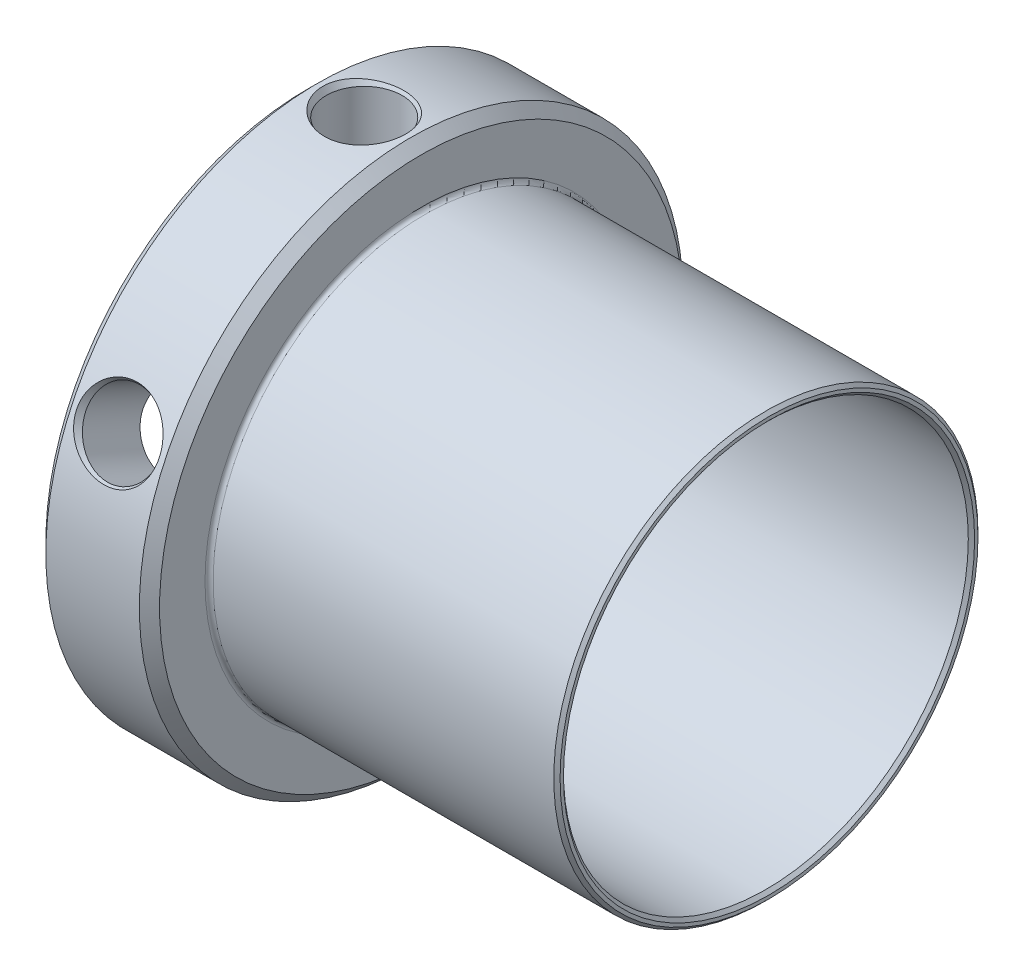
ISO-10303-21;
HEADER;
FILE_DESCRIPTION(('STEP AP214'),'2;1');
FILE_NAME('part.step','',(''),(''),'','','');
FILE_SCHEMA(('AUTOMOTIVE_DESIGN { 1 0 10303 214 1 1 1 1 }'));
ENDSEC;
DATA;
#1=APPLICATION_CONTEXT('core data for automotive mechanical design processes');
#2=APPLICATION_PROTOCOL_DEFINITION('international standard','automotive_design',2000,#1);
#3=PRODUCT_CONTEXT('',#1,'mechanical');
#4=PRODUCT('Part','Part','',(#3));
#5=PRODUCT_RELATED_PRODUCT_CATEGORY('part','',(#4));
#6=PRODUCT_DEFINITION_FORMATION('','',#4);
#7=PRODUCT_DEFINITION_CONTEXT('part definition',#1,'design');
#8=PRODUCT_DEFINITION('design','',#6,#7);
#9=PRODUCT_DEFINITION_SHAPE('','',#8);
#10=(LENGTH_UNIT() NAMED_UNIT(*) SI_UNIT(.MILLI.,.METRE.));
#11=(NAMED_UNIT(*) PLANE_ANGLE_UNIT() SI_UNIT($,.RADIAN.));
#12=(NAMED_UNIT(*) SI_UNIT($,.STERADIAN.) SOLID_ANGLE_UNIT());
#13=UNCERTAINTY_MEASURE_WITH_UNIT(LENGTH_MEASURE(1.E-05),#10,'distance_accuracy_value','');
#14=(GEOMETRIC_REPRESENTATION_CONTEXT(3) GLOBAL_UNCERTAINTY_ASSIGNED_CONTEXT((#13)) GLOBAL_UNIT_ASSIGNED_CONTEXT((#10,
#11,#12)) REPRESENTATION_CONTEXT('',''));
#15=CARTESIAN_POINT('',(0.,0.,0.));
#16=DIRECTION('',(0.,0.,1.));
#17=DIRECTION('',(1.,0.,0.));
#18=AXIS2_PLACEMENT_3D('',#15,#16,#17);
#19=CARTESIAN_POINT('',(14.3002,0.,0.));
#20=DIRECTION('',(1.,0.,0.));
#21=DIRECTION('',(0.,0.,-1.));
#22=AXIS2_PLACEMENT_3D('',#19,#20,#21);
#23=PLANE('',#22);
#24=CARTESIAN_POINT('',(14.3002,0.,0.));
#25=DIRECTION('',(1.,0.,0.));
#26=DIRECTION('',(0.,0.,-1.));
#27=AXIS2_PLACEMENT_3D('',#24,#25,#26);
#28=CIRCLE('',#27,27.178);
#29=CARTESIAN_POINT('',(14.3002,0.,-27.178));
#30=VERTEX_POINT('',#29);
#31=EDGE_CURVE('E97',#30,#30,#28,.F.);
#32=ORIENTED_EDGE('',*,*,#31,.T.);
#33=EDGE_LOOP('',(#32));
#34=FACE_BOUND('',#33,.T.);
#35=CARTESIAN_POINT('',(14.3002,0.,0.));
#36=DIRECTION('',(1.,0.,0.));
#37=DIRECTION('',(0.,0.,-1.));
#38=AXIS2_PLACEMENT_3D('',#35,#36,#37);
#39=CIRCLE('',#38,32.893);
#40=CARTESIAN_POINT('',(14.3002,0.,-32.893));
#41=VERTEX_POINT('',#40);
#42=EDGE_CURVE('E76',#41,#41,#39,.T.);
#43=ORIENTED_EDGE('',*,*,#42,.T.);
#44=EDGE_LOOP('',(#43));
#45=FACE_BOUND('',#44,.T.);
#46=ADVANCED_FACE('F17',(#34,#45),#23,.T.);
#47=CARTESIAN_POINT('',(14.3002,0.,0.));
#48=DIRECTION('',(-1.,0.,0.));
#49=DIRECTION('',(0.,0.,1.));
#50=AXIS2_PLACEMENT_3D('',#47,#48,#49);
#51=CYLINDRICAL_SURFACE('',#50,34.163);
#52=CARTESIAN_POINT('',(3.10159654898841,11.5167493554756,32.1632566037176));
#53=CARTESIAN_POINT('',(2.91411245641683,11.7253798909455,32.0885495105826));
#54=CARTESIAN_POINT('',(2.74549993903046,11.9485518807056,32.0063374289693));
#55=CARTESIAN_POINT('',(2.45216736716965,12.4171209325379,31.8274801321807));
#56=CARTESIAN_POINT('',(2.32747788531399,12.6625333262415,31.7308249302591));
#57=CARTESIAN_POINT('',(2.13097094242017,13.1574188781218,31.5287393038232));
#58=CARTESIAN_POINT('',(2.057237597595,13.4063366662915,31.4238147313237));
#59=CARTESIAN_POINT('',(1.9576876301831,13.9094002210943,31.2043961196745));
#60=CARTESIAN_POINT('',(1.93184979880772,14.1635436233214,31.0899063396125));
#61=CARTESIAN_POINT('',(1.92911987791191,14.6597955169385,30.8589233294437));
#62=CARTESIAN_POINT('',(1.9504612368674,14.90200267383,30.7426589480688));
#63=CARTESIAN_POINT('',(2.03768382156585,15.3770718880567,30.5078097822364));
#64=CARTESIAN_POINT('',(2.10356440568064,15.6099340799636,30.3892250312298));
#65=CARTESIAN_POINT('',(2.27725872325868,16.0596300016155,30.1539908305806));
#66=CARTESIAN_POINT('',(2.38496907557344,16.2765016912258,30.0373373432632));
#67=CARTESIAN_POINT('',(2.63870532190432,16.6898017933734,29.8096768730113));
#68=CARTESIAN_POINT('',(2.78473641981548,16.8862274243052,29.6986706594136));
#69=CARTESIAN_POINT('',(3.11595356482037,17.2606113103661,29.4827092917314));
#70=CARTESIAN_POINT('',(3.30226137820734,17.4377582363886,29.378069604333));
#71=CARTESIAN_POINT('',(3.70540152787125,17.7625835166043,29.1828236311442));
#72=CARTESIAN_POINT('',(3.92224014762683,17.9102557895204,29.092220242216));
#73=CARTESIAN_POINT('',(4.39056931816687,18.1794069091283,28.9248339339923));
#74=CARTESIAN_POINT('',(4.64316211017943,18.2994539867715,28.8488308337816));
#75=CARTESIAN_POINT('',(5.16808236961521,18.5026909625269,28.7189066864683));
#76=CARTESIAN_POINT('',(5.4404129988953,18.585874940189,28.6649891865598));
#77=CARTESIAN_POINT('',(6.0060959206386,18.7160277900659,28.580188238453));
#78=CARTESIAN_POINT('',(6.29983710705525,18.7618045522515,28.5500639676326));
#79=CARTESIAN_POINT('',(6.89234543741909,18.8120227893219,28.5169998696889));
#80=CARTESIAN_POINT('',(7.19111298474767,18.8164609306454,28.5140622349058));
#81=CARTESIAN_POINT('',(7.78885721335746,18.7837345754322,28.5356316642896));
#82=CARTESIAN_POINT('',(8.08779620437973,18.7460874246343,28.5604571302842));
#83=CARTESIAN_POINT('',(8.67385533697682,18.6290368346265,28.6369410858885));
#84=CARTESIAN_POINT('',(8.96097498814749,18.5496316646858,28.6886006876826));
#85=CARTESIAN_POINT('',(9.51451552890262,18.3506201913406,28.8163007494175));
#86=CARTESIAN_POINT('',(9.78097615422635,18.2310935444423,28.8922928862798));
#87=CARTESIAN_POINT('',(10.2858117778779,17.9539388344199,29.0653270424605));
#88=CARTESIAN_POINT('',(10.5241880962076,17.7963125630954,29.1623680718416));
#89=CARTESIAN_POINT('',(10.961183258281,17.4492547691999,29.3713169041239));
#90=CARTESIAN_POINT('',(11.1604450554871,17.2604522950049,29.4829229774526));
#91=CARTESIAN_POINT('',(11.5177120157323,16.8532145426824,29.7175838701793));
#92=CARTESIAN_POINT('',(11.6757272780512,16.634786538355,29.8406358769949));
#93=CARTESIAN_POINT('',(11.9393196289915,16.1828405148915,30.0880362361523));
#94=CARTESIAN_POINT('',(12.0467081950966,15.9502486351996,30.2121450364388));
#95=CARTESIAN_POINT('',(12.2138352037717,15.4690289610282,30.4613357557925));
#96=CARTESIAN_POINT('',(12.2735882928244,15.2204061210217,30.5864173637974));
#97=CARTESIAN_POINT('',(12.3415474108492,14.7254753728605,30.8276412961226));
#98=CARTESIAN_POINT('',(12.3518659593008,14.4795302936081,30.9439364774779));
#99=CARTESIAN_POINT('',(12.3263045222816,13.9869303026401,31.1696924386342));
#100=CARTESIAN_POINT('',(12.2904300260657,13.7402754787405,31.2791540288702));
#101=CARTESIAN_POINT('',(12.1747991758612,13.2575160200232,31.4867725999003));
#102=CARTESIAN_POINT('',(12.095754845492,13.0213056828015,31.5850825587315));
#103=CARTESIAN_POINT('',(11.8970591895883,12.5619820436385,31.7705617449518));
#104=CARTESIAN_POINT('',(11.7774044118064,12.3388698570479,31.8577300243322));
#105=CARTESIAN_POINT('',(11.4982638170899,11.9069897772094,32.0216922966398));
#106=CARTESIAN_POINT('',(11.337942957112,11.6986571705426,32.0982089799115));
#107=CARTESIAN_POINT('',(10.9838657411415,11.3075715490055,32.238061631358));
#108=CARTESIAN_POINT('',(10.7901027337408,11.1248236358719,32.3013949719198));
#109=CARTESIAN_POINT('',(10.3656025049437,10.7823151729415,32.4173782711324));
#110=CARTESIAN_POINT('',(10.1336287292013,10.6238904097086,32.4694478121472));
#111=CARTESIAN_POINT('',(9.6458051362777,10.3441915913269,32.5596365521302));
#112=CARTESIAN_POINT('',(9.38995083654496,10.2229245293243,32.5977531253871));
#113=CARTESIAN_POINT('',(8.8513998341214,10.016996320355,32.6616362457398));
#114=CARTESIAN_POINT('',(8.56806009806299,9.93385635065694,32.686893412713));
#115=CARTESIAN_POINT('',(7.99094227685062,9.81333242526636,32.72328019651));
#116=CARTESIAN_POINT('',(7.69716349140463,9.77595154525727,32.7344088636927));
#117=CARTESIAN_POINT('',(7.10199441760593,9.74776074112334,32.7428156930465));
#118=CARTESIAN_POINT('',(6.80056103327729,9.7577796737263,32.7398473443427));
#119=CARTESIAN_POINT('',(6.20360736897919,9.82602206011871,32.7194299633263));
#120=CARTESIAN_POINT('',(5.90808882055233,9.88425942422,32.7019767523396));
#121=CARTESIAN_POINT('',(5.33068129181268,10.0474560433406,32.6522044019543));
#122=CARTESIAN_POINT('',(5.04883202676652,10.152543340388,32.6198445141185));
#123=CARTESIAN_POINT('',(4.50811593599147,10.4063335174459,32.5397661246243));
#124=CARTESIAN_POINT('',(4.24922300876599,10.5549860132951,32.4920653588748));
#125=CARTESIAN_POINT('',(3.83908556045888,10.8382656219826,32.3984134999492));
#126=CARTESIAN_POINT('',(3.67962753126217,10.962550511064,32.3566479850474));
#127=CARTESIAN_POINT('',(3.37747000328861,11.2276931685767,32.2656033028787));
#128=CARTESIAN_POINT('',(3.23477226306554,11.3685526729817,32.2163233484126));
#129=CARTESIAN_POINT('',(3.10159654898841,11.5167493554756,32.1632566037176));
#130=B_SPLINE_CURVE_WITH_KNOTS('',3,(#52,#53,#54,#55,#56,#57,#58,#59,#60,#61,#62,#63,#64,#65,
#66,#67,#68,#69,#70,#71,#72,#73,#74,#75,#76,#77,#78,#79,#80,#81,#82,#83,#84,#85,#86,#87,#88,#89,
#90,#91,#92,#93,#94,#95,#96,#97,#98,#99,#100,#101,#102,#103,#104,#105,#106,#107,#108,#109,#110,
#111,#112,#113,#114,#115,#116,#117,#118,#119,#120,#121,#122,#123,#124,#125,#126,#127,#128,#129),
.UNSPECIFIED.,.T.,.F.,(4,2,2,2,2,2,2,2,2,2,2,2,2,2,2,2,2,2,2,2,2,2,2,2,2,2,2,2,2,2,2,2,2,2,2,2,
2,2,4),(0.,0.870031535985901,1.74066746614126,2.57646768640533,3.41189771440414,
4.21657789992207,5.02124649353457,5.8239388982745,6.62674036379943,7.45572700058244,
8.28488449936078,9.15038444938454,10.0160233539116,10.9082773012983,11.8006031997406,
12.7032686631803,13.6059715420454,14.5068927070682,15.4077715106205,16.2923027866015,
17.1766172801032,18.0262950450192,18.8757114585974,19.6884843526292,20.5011606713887,
21.3008209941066,22.1005493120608,22.9182580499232,23.7361296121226,24.5893686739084,
25.4427682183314,26.3277574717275,27.2128062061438,28.1133879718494,29.0142296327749,
29.9175485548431,30.8198268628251,31.4377722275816,32.0557823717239),.UNSPECIFIED.);
#131=CARTESIAN_POINT('',(12.3444,14.4379076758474,30.9621929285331));
#132=VERTEX_POINT('',#131);
#133=CARTESIAN_POINT('',(1.9304,14.4379076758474,30.9621929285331));
#134=VERTEX_POINT('',#133);
#135=EDGE_CURVE('E21',#132,#134,#130,.T.);
#136=ORIENTED_EDGE('',*,*,#135,.T.);
#137=EDGE_CURVE('E11',#134,#132,#130,.T.);
#138=ORIENTED_EDGE('',*,*,#137,.T.);
#139=EDGE_LOOP('',(#136,#138));
#140=FACE_BOUND('',#139,.T.);
#141=CARTESIAN_POINT('',(3.53038668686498,33.9726462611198,-3.60137131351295));
#142=CARTESIAN_POINT('',(3.74170996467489,33.951999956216,-3.79613782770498));
#143=CARTESIAN_POINT('',(3.9695953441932,33.9315337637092,-3.97322760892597));
#144=CARTESIAN_POINT('',(4.45169731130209,33.8932265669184,-4.28777489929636));
#145=CARTESIAN_POINT('',(4.70594787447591,33.8753890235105,-4.42518038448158));
#146=CARTESIAN_POINT('',(5.23881874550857,33.8439746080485,-4.65942599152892));
#147=CARTESIAN_POINT('',(5.51782214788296,33.8304891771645,-4.75540824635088));
#148=CARTESIAN_POINT('',(6.08788487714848,33.8097672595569,-4.90057358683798));
#149=CARTESIAN_POINT('',(6.3789420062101,33.8025296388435,-4.94976516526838));
#150=CARTESIAN_POINT('',(6.97122663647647,33.7950189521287,-5.00079774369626));
#151=CARTESIAN_POINT('',(7.27254075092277,33.7948898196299,-5.00166017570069));
#152=CARTESIAN_POINT('',(7.87110234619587,33.8019771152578,-4.95353227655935));
#153=CARTESIAN_POINT('',(8.16834937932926,33.8091943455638,-4.90453650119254));
#154=CARTESIAN_POINT('',(8.75142139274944,33.8301891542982,-4.7575582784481));
#155=CARTESIAN_POINT('',(9.03720020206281,33.8439908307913,-4.65939582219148));
#156=CARTESIAN_POINT('',(9.58785487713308,33.8765665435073,-4.41630717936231));
#157=CARTESIAN_POINT('',(9.85273067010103,33.8953405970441,-4.27138082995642));
#158=CARTESIAN_POINT('',(10.3510898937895,33.9354580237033,-3.9398942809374));
#159=CARTESIAN_POINT('',(10.584853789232,33.9567746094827,-3.75375305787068));
#160=CARTESIAN_POINT('',(11.0165130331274,33.9995988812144,-3.34368155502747));
#161=CARTESIAN_POINT('',(11.2144138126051,34.0211065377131,-3.11975700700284));
#162=CARTESIAN_POINT('',(11.5621268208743,34.0610690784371,-2.64736507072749));
#163=CARTESIAN_POINT('',(11.713204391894,34.0795962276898,-2.39983633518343));
#164=CARTESIAN_POINT('',(11.9695690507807,34.1121162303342,-1.88182551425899));
#165=CARTESIAN_POINT('',(12.074870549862,34.1261105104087,-1.61135068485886));
#166=CARTESIAN_POINT('',(12.2318856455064,34.1473262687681,-1.06825073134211));
#167=CARTESIAN_POINT('',(12.2858014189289,34.1548246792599,-0.796272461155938));
#168=CARTESIAN_POINT('',(12.3459859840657,34.1632097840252,-0.24701230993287));
#169=CARTESIAN_POINT('',(12.3522653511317,34.1640979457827,0.030268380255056));
#170=CARTESIAN_POINT('',(12.3175146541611,34.1592399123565,0.572932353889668));
#171=CARTESIAN_POINT('',(12.2779745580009,34.1537026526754,0.838414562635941));
#172=CARTESIAN_POINT('',(12.1554856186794,34.1369544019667,1.35895546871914));
#173=CARTESIAN_POINT('',(12.0725367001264,34.125743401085,1.61401414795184));
#174=CARTESIAN_POINT('',(11.8655549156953,34.098788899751,2.1082796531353));
#175=CARTESIAN_POINT('',(11.7412916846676,34.0830200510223,2.34738835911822));
#176=CARTESIAN_POINT('',(11.4558767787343,34.0486453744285,2.80221768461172));
#177=CARTESIAN_POINT('',(11.2947191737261,34.0300390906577,3.01793453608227));
#178=CARTESIAN_POINT('',(10.9337129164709,33.9911725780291,3.4285451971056));
#179=CARTESIAN_POINT('',(10.7326476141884,33.9708765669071,3.62236537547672));
#180=CARTESIAN_POINT('',(10.3018761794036,33.9314069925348,3.97514497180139));
#181=CARTESIAN_POINT('',(10.0721641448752,33.9122336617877,4.13409718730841));
#182=CARTESIAN_POINT('',(9.58000363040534,33.8762208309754,4.41971812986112));
#183=CARTESIAN_POINT('',(9.31657603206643,33.8595159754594,4.54471817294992));
#184=CARTESIAN_POINT('',(8.77266735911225,33.8312858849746,4.75031381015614));
#185=CARTESIAN_POINT('',(8.4921838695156,33.8197613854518,4.8309030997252));
#186=CARTESIAN_POINT('',(7.91408207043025,33.8029165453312,4.94742554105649));
#187=CARTESIAN_POINT('',(7.61620624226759,33.7977699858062,4.98210953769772));
#188=CARTESIAN_POINT('',(7.01876456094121,33.7948362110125,5.00197097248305));
#189=CARTESIAN_POINT('',(6.71919858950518,33.79704951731,4.9871449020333));
#190=CARTESIAN_POINT('',(6.1242320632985,33.8086349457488,4.90799047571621));
#191=CARTESIAN_POINT('',(5.82888787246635,33.8180672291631,4.84324607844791));
#192=CARTESIAN_POINT('',(5.25343473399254,33.8430765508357,4.66527107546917));
#193=CARTESIAN_POINT('',(4.97332626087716,33.8586537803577,4.55203896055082));
#194=CARTESIAN_POINT('',(4.43783715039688,33.8940590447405,4.28041154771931));
#195=CARTESIAN_POINT('',(4.18234802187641,33.9138670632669,4.12222779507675));
#196=CARTESIAN_POINT('',(3.70247732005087,33.9554538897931,3.76431450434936));
#197=CARTESIAN_POINT('',(3.47809326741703,33.9772325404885,3.56458828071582));
#198=CARTESIAN_POINT('',(3.07247485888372,34.0196509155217,3.13363125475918));
#199=CARTESIAN_POINT('',(2.8903851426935,34.0403052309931,2.90320807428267));
#200=CARTESIAN_POINT('',(2.56942193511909,34.0785038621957,2.41375758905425));
#201=CARTESIAN_POINT('',(2.43053642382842,34.0960490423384,2.15473826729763));
#202=CARTESIAN_POINT('',(2.20615546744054,34.1252077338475,1.62713073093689));
#203=CARTESIAN_POINT('',(2.11865351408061,34.1370403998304,1.3594081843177));
#204=CARTESIAN_POINT('',(1.99156552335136,34.1544264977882,0.812647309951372));
#205=CARTESIAN_POINT('',(1.95196439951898,34.1599819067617,0.533612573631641));
#206=CARTESIAN_POINT('',(1.92284190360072,34.1640572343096,-0.0158553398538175));
#207=CARTESIAN_POINT('',(1.93137804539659,34.1628500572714,-0.286185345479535));
#208=CARTESIAN_POINT('',(1.99371368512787,34.1541704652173,-0.821507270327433));
#209=CARTESIAN_POINT('',(2.04751879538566,34.1466972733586,-1.08649852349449));
#210=CARTESIAN_POINT('',(2.19780141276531,34.126405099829,-1.60158085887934));
#211=CARTESIAN_POINT('',(2.29394693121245,34.1136277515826,-1.85177101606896));
#212=CARTESIAN_POINT('',(2.52548938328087,34.0841115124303,-2.33280009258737));
#213=CARTESIAN_POINT('',(2.66085422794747,34.0673758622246,-2.56365463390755));
#214=CARTESIAN_POINT('',(2.91786265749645,34.0373582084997,-2.93108953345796));
#215=CARTESIAN_POINT('',(3.03021362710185,34.0246670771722,-3.07432783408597));
#216=CARTESIAN_POINT('',(3.26962929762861,33.9988420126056,-3.34785926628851));
#217=CARTESIAN_POINT('',(3.39669356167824,33.9857080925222,-3.4781527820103));
#218=CARTESIAN_POINT('',(3.53038668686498,33.9726462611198,-3.60137131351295));
#219=B_SPLINE_CURVE_WITH_KNOTS('',3,(#141,#142,#143,#144,#145,#146,#147,#148,#149,#150,#151,
#152,#153,#154,#155,#156,#157,#158,#159,#160,#161,#162,#163,#164,#165,#166,#167,#168,#169,#170,
#171,#172,#173,#174,#175,#176,#177,#178,#179,#180,#181,#182,#183,#184,#185,#186,#187,#188,#189,
#190,#191,#192,#193,#194,#195,#196,#197,#198,#199,#200,#201,#202,#203,#204,#205,#206,#207,#208,
#209,#210,#211,#212,#213,#214,#215,#216,#217,#218),.UNSPECIFIED.,.T.,.F.,(4,2,2,2,2,2,2,2,2,2,2,
2,2,2,2,2,2,2,2,2,2,2,2,2,2,2,2,2,2,2,2,2,2,2,2,2,2,2,4),(0.,0.863735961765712,1.72859914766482,
2.61060174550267,3.49244422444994,4.39213592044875,5.29192586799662,6.19503447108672,
7.09814621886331,7.99246746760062,8.88665316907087,9.75399363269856,10.621060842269,
11.4490322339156,12.2768198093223,13.0784270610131,13.8800357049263,14.6861911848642,
15.4924763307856,16.3287661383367,17.1652285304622,18.0374144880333,18.909724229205,
19.805313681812,20.7009666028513,21.604166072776,22.5073936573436,23.4064390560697,
24.3054127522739,25.1842115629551,26.0627656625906,26.9042283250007,27.7454258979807,
28.5529279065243,29.3605300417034,30.1619095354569,30.9626351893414,31.5090917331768,
32.0555320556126),.UNSPECIFIED.);
#220=CARTESIAN_POINT('',(1.9304,34.163,0.));
#221=VERTEX_POINT('',#220);
#222=CARTESIAN_POINT('',(12.3444000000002,34.163,0.));
#223=VERTEX_POINT('',#222);
#224=EDGE_CURVE('E52',#221,#223,#219,.T.);
#225=ORIENTED_EDGE('',*,*,#224,.T.);
#226=EDGE_CURVE('E40',#223,#221,#219,.T.);
#227=ORIENTED_EDGE('',*,*,#226,.T.);
#228=EDGE_LOOP('',(#225,#227));
#229=FACE_BOUND('',#228,.T.);
#230=CARTESIAN_POINT('',(1.27,0.,0.));
#231=DIRECTION('',(1.,0.,0.));
#232=DIRECTION('',(0.,0.,-1.));
#233=AXIS2_PLACEMENT_3D('',#230,#231,#232);
#234=CIRCLE('',#233,34.163);
#235=CARTESIAN_POINT('',(1.27,0.,-34.163));
#236=VERTEX_POINT('',#235);
#237=EDGE_CURVE('E56',#236,#236,#234,.T.);
#238=ORIENTED_EDGE('',*,*,#237,.T.);
#239=EDGE_LOOP('',(#238));
#240=FACE_BOUND('',#239,.T.);
#241=CARTESIAN_POINT('',(13.0302,0.,0.));
#242=DIRECTION('',(1.,0.,0.));
#243=DIRECTION('',(0.,0.,-1.));
#244=AXIS2_PLACEMENT_3D('',#241,#242,#243);
#245=CIRCLE('',#244,34.163);
#246=CARTESIAN_POINT('',(13.0302,0.,-34.163));
#247=VERTEX_POINT('',#246);
#248=EDGE_CURVE('E59',#247,#247,#245,.F.);
#249=ORIENTED_EDGE('',*,*,#248,.T.);
#250=EDGE_LOOP('',(#249));
#251=FACE_BOUND('',#250,.T.);
#252=ADVANCED_FACE('F47',(#140,#229,#240,#251),#51,.T.);
#253=CARTESIAN_POINT('',(0.,0.,0.));
#254=DIRECTION('',(1.,0.,0.));
#255=DIRECTION('',(0.,0.,-1.));
#256=AXIS2_PLACEMENT_3D('',#253,#254,#255);
#257=PLANE('',#256);
#258=CARTESIAN_POINT('',(0.,0.,0.));
#259=DIRECTION('',(1.,0.,0.));
#260=DIRECTION('',(0.,0.,-1.));
#261=AXIS2_PLACEMENT_3D('',#258,#259,#260);
#262=CIRCLE('',#261,25.847675);
#263=CARTESIAN_POINT('',(0.,0.,-25.847675));
#264=VERTEX_POINT('',#263);
#265=EDGE_CURVE('E85',#264,#264,#262,.T.);
#266=ORIENTED_EDGE('',*,*,#265,.T.);
#267=EDGE_LOOP('',(#266));
#268=FACE_BOUND('',#267,.T.);
#269=CARTESIAN_POINT('',(0.,0.,0.));
#270=DIRECTION('',(1.,0.,0.));
#271=DIRECTION('',(0.,0.,-1.));
#272=AXIS2_PLACEMENT_3D('',#269,#270,#271);
#273=CIRCLE('',#272,32.893);
#274=CARTESIAN_POINT('',(0.,0.,-32.893));
#275=VERTEX_POINT('',#274);
#276=EDGE_CURVE('E63',#275,#275,#273,.F.);
#277=ORIENTED_EDGE('',*,*,#276,.T.);
#278=EDGE_LOOP('',(#277));
#279=FACE_BOUND('',#278,.T.);
#280=ADVANCED_FACE('F50',(#268,#279),#257,.F.);
#281=CARTESIAN_POINT('',(1.27,0.,0.));
#282=DIRECTION('',(1.,0.,0.));
#283=DIRECTION('',(0.,0.,-1.));
#284=AXIS2_PLACEMENT_3D('',#281,#282,#283);
#285=CONICAL_SURFACE('',#284,34.163,0.785398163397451);
#286=ORIENTED_EDGE('',*,*,#276,.F.);
#287=EDGE_LOOP('',(#286));
#288=FACE_BOUND('',#287,.T.);
#289=ORIENTED_EDGE('',*,*,#237,.F.);
#290=EDGE_LOOP('',(#289));
#291=FACE_BOUND('',#290,.T.);
#292=ADVANCED_FACE('F138',(#288,#291),#285,.T.);
#293=CARTESIAN_POINT('',(14.3002,0.,0.));
#294=DIRECTION('',(-1.,0.,0.));
#295=DIRECTION('',(0.,0.,1.));
#296=AXIS2_PLACEMENT_3D('',#293,#294,#295);
#297=CONICAL_SURFACE('',#296,32.893,0.785398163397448);
#298=ORIENTED_EDGE('',*,*,#248,.F.);
#299=EDGE_LOOP('',(#298));
#300=FACE_BOUND('',#299,.T.);
#301=ORIENTED_EDGE('',*,*,#42,.F.);
#302=EDGE_LOOP('',(#301));
#303=FACE_BOUND('',#302,.T.);
#304=ADVANCED_FACE('F133',(#300,#303),#297,.T.);
#305=CARTESIAN_POINT('',(58.039,0.,0.));
#306=DIRECTION('',(-1.,0.,0.));
#307=DIRECTION('',(0.,0.,1.));
#308=AXIS2_PLACEMENT_3D('',#305,#306,#307);
#309=CYLINDRICAL_SURFACE('',#308,26.67);
#310=CARTESIAN_POINT('',(14.8082,0.,0.));
#311=DIRECTION('',(1.,0.,0.));
#312=DIRECTION('',(0.,0.,-1.));
#313=AXIS2_PLACEMENT_3D('',#310,#311,#312);
#314=CIRCLE('',#313,26.67);
#315=CARTESIAN_POINT('',(14.8082,0.,-26.67));
#316=VERTEX_POINT('',#315);
#317=EDGE_CURVE('E100',#316,#316,#314,.T.);
#318=ORIENTED_EDGE('',*,*,#317,.T.);
#319=EDGE_LOOP('',(#318));
#320=FACE_BOUND('',#319,.T.);
#321=CARTESIAN_POINT('',(57.642125,0.,0.));
#322=DIRECTION('',(1.,0.,0.));
#323=DIRECTION('',(0.,0.,-1.));
#324=AXIS2_PLACEMENT_3D('',#321,#322,#323);
#325=CIRCLE('',#324,26.67);
#326=CARTESIAN_POINT('',(57.642125,0.,-26.67));
#327=VERTEX_POINT('',#326);
#328=EDGE_CURVE('E94',#327,#327,#325,.F.);
#329=ORIENTED_EDGE('',*,*,#328,.T.);
#330=EDGE_LOOP('',(#329));
#331=FACE_BOUND('',#330,.T.);
#332=ADVANCED_FACE('F129',(#320,#331),#309,.T.);
#333=CARTESIAN_POINT('',(58.039,0.,0.));
#334=DIRECTION('',(1.,0.,0.));
#335=DIRECTION('',(0.,0.,-1.));
#336=AXIS2_PLACEMENT_3D('',#333,#334,#335);
#337=PLANE('',#336);
#338=CARTESIAN_POINT('',(58.039,0.,0.));
#339=DIRECTION('',(1.,0.,0.));
#340=DIRECTION('',(0.,0.,-1.));
#341=AXIS2_PLACEMENT_3D('',#338,#339,#340);
#342=CIRCLE('',#341,25.847675);
#343=CARTESIAN_POINT('',(58.039,0.,-25.847675));
#344=VERTEX_POINT('',#343);
#345=EDGE_CURVE('E91',#344,#344,#342,.F.);
#346=ORIENTED_EDGE('',*,*,#345,.T.);
#347=EDGE_LOOP('',(#346));
#348=FACE_BOUND('',#347,.T.);
#349=CARTESIAN_POINT('',(58.039,0.,0.));
#350=DIRECTION('',(1.,0.,0.));
#351=DIRECTION('',(0.,0.,-1.));
#352=AXIS2_PLACEMENT_3D('',#349,#350,#351);
#353=CIRCLE('',#352,26.273125);
#354=CARTESIAN_POINT('',(58.039,0.,-26.273125));
#355=VERTEX_POINT('',#354);
#356=EDGE_CURVE('E88',#355,#355,#353,.T.);
#357=ORIENTED_EDGE('',*,*,#356,.T.);
#358=EDGE_LOOP('',(#357));
#359=FACE_BOUND('',#358,.T.);
#360=ADVANCED_FACE('F125',(#348,#359),#337,.T.);
#361=CARTESIAN_POINT('',(58.04,0.,0.));
#362=DIRECTION('',(-1.,0.,0.));
#363=DIRECTION('',(0.,0.,1.));
#364=AXIS2_PLACEMENT_3D('',#361,#362,#363);
#365=CYLINDRICAL_SURFACE('',#364,25.4508);
#366=CARTESIAN_POINT('',(7.1374,6.24968817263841,24.6715345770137));
#367=CARTESIAN_POINT('',(7.40238679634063,6.24969955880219,24.6715349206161));
#368=CARTESIAN_POINT('',(7.66750570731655,6.27159976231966,24.6660159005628));
#369=CARTESIAN_POINT('',(8.19026850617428,6.35841244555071,24.6437769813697));
#370=CARTESIAN_POINT('',(8.44790584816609,6.4233614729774,24.6270475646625));
#371=CARTESIAN_POINT('',(8.9480659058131,6.59376473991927,24.581968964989));
#372=CARTESIAN_POINT('',(9.19060243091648,6.69918132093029,24.5536305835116));
#373=CARTESIAN_POINT('',(9.65417985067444,6.9467593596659,24.4847338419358));
#374=CARTESIAN_POINT('',(9.87522243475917,7.08891792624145,24.4441764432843));
#375=CARTESIAN_POINT('',(10.2922941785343,7.40699847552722,24.3496888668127));
#376=CARTESIAN_POINT('',(10.4880182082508,7.58327796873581,24.2956151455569));
#377=CARTESIAN_POINT('',(10.8462385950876,7.96285653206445,24.1738658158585));
#378=CARTESIAN_POINT('',(11.0087327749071,8.16615737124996,24.1061893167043));
#379=CARTESIAN_POINT('',(11.2970496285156,8.59504294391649,23.9566346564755));
#380=CARTESIAN_POINT('',(11.4225846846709,8.8207850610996,23.8746526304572));
#381=CARTESIAN_POINT('',(11.6315668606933,9.28616004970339,23.6975180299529));
#382=CARTESIAN_POINT('',(11.7150174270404,9.52579178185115,23.602366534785));
#383=CARTESIAN_POINT('',(11.8365184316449,10.0086799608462,23.4016471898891));
#384=CARTESIAN_POINT('',(11.8750832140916,10.2518623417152,23.2962126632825));
#385=CARTESIAN_POINT('',(11.9073204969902,10.7372102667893,23.076534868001));
#386=CARTESIAN_POINT('',(11.900996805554,10.9793758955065,22.9622923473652));
#387=CARTESIAN_POINT('',(11.8440312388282,11.4526916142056,22.7298868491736));
#388=CARTESIAN_POINT('',(11.7939431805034,11.6839414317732,22.611790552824));
#389=CARTESIAN_POINT('',(11.6517465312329,12.1324468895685,22.3743465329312));
#390=CARTESIAN_POINT('',(11.5596364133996,12.3497020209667,22.2549987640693));
#391=CARTESIAN_POINT('',(11.3354821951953,12.7660153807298,22.0188493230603));
#392=CARTESIAN_POINT('',(11.2032165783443,12.964964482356,21.9020657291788));
#393=CARTESIAN_POINT('',(10.9026691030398,13.3387229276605,21.6764715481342));
#394=CARTESIAN_POINT('',(10.7343835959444,13.513529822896,21.5676617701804));
#395=CARTESIAN_POINT('',(10.3635211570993,13.8376883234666,21.3611602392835));
#396=CARTESIAN_POINT('',(10.1604597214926,13.9866103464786,21.2636636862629));
#397=CARTESIAN_POINT('',(9.72742392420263,14.2524627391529,21.0863969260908));
#398=CARTESIAN_POINT('',(9.49744917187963,14.3693926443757,21.0066269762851));
#399=CARTESIAN_POINT('',(9.01649075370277,14.5688803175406,20.8687744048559));
#400=CARTESIAN_POINT('',(8.76547233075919,14.6513798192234,20.8107285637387));
#401=CARTESIAN_POINT('',(8.24990779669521,14.7798311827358,20.7197024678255));
#402=CARTESIAN_POINT('',(7.98536321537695,14.8257871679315,20.6867193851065));
#403=CARTESIAN_POINT('',(7.45450989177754,14.8796670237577,20.6479981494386));
#404=CARTESIAN_POINT('',(7.1882872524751,14.8881514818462,20.6418584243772));
#405=CARTESIAN_POINT('',(6.65792864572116,14.868421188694,20.6560745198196));
#406=CARTESIAN_POINT('',(6.39379257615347,14.8402082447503,20.6764290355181));
#407=CARTESIAN_POINT('',(5.87733179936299,14.748128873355,20.7422043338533));
#408=CARTESIAN_POINT('',(5.62492782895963,14.6845575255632,20.7874176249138));
#409=CARTESIAN_POINT('',(5.13655765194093,14.5233816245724,20.9003404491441));
#410=CARTESIAN_POINT('',(4.90059265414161,14.4257745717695,20.9680516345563));
#411=CARTESIAN_POINT('',(4.44881211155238,14.1972891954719,21.1234333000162));
#412=CARTESIAN_POINT('',(4.23325948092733,14.0660411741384,21.2113243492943));
#413=CARTESIAN_POINT('',(3.83116164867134,13.7736095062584,21.402367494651));
#414=CARTESIAN_POINT('',(3.64461904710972,13.6124231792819,21.5055209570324));
#415=CARTESIAN_POINT('',(3.30330544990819,13.2612160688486,21.7238718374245));
#416=CARTESIAN_POINT('',(3.14899021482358,13.0708401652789,21.839211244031));
#417=CARTESIAN_POINT('',(2.87972791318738,12.6672464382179,22.0757495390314));
#418=CARTESIAN_POINT('',(2.76477933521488,12.4540294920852,22.1969482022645));
#419=CARTESIAN_POINT('',(2.57819608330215,12.0112071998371,22.4396408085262));
#420=CARTESIAN_POINT('',(2.50633731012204,11.7816937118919,22.5611298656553));
#421=CARTESIAN_POINT('',(2.40725817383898,11.3114454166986,22.8005258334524));
#422=CARTESIAN_POINT('',(2.38003313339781,11.0707117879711,22.918433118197));
#423=CARTESIAN_POINT('',(2.37115659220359,10.5886290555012,23.145064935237));
#424=CARTESIAN_POINT('',(2.38881663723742,10.3473452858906,23.2539020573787));
#425=CARTESIAN_POINT('',(2.46770148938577,9.86759376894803,23.461503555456));
#426=CARTESIAN_POINT('',(2.5289258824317,9.62912599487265,23.5602680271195));
#427=CARTESIAN_POINT('',(2.69291187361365,9.16250363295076,23.7456252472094));
#428=CARTESIAN_POINT('',(2.79560046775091,8.93433169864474,23.832239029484));
#429=CARTESIAN_POINT('',(3.03951749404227,8.49464194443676,23.9924801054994));
#430=CARTESIAN_POINT('',(3.18074849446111,8.28312523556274,24.0661065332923));
#431=CARTESIAN_POINT('',(3.50011236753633,7.88025293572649,24.2010468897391));
#432=CARTESIAN_POINT('',(3.67874274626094,7.68922785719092,24.2621702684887));
#433=CARTESIAN_POINT('',(4.0668021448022,7.33686750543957,24.371042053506));
#434=CARTESIAN_POINT('',(4.27623839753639,7.17553922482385,24.4187873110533));
#435=CARTESIAN_POINT('',(4.72227164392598,6.88663476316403,24.5018438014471));
#436=CARTESIAN_POINT('',(4.95910101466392,6.7593831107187,24.5370364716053));
#437=CARTESIAN_POINT('',(5.45160505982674,6.54526603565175,24.5950222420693));
#438=CARTESIAN_POINT('',(5.70726166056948,6.45836245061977,24.6178270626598));
#439=CARTESIAN_POINT('',(6.15929796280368,6.34570452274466,24.6470604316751));
#440=CARTESIAN_POINT('',(6.35302938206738,6.30977233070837,24.6562489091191));
#441=CARTESIAN_POINT('',(6.74361626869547,6.26176024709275,24.6684857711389));
#442=CARTESIAN_POINT('',(6.94047165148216,6.24967971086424,24.6715343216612));
#443=CARTESIAN_POINT('',(7.1374,6.24968817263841,24.6715345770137));
#444=B_SPLINE_CURVE_WITH_KNOTS('',3,(#366,#367,#368,#369,#370,#371,#372,#373,#374,#375,#376,
#377,#378,#379,#380,#381,#382,#383,#384,#385,#386,#387,#388,#389,#390,#391,#392,#393,#394,#395,
#396,#397,#398,#399,#400,#401,#402,#403,#404,#405,#406,#407,#408,#409,#410,#411,#412,#413,#414,
#415,#416,#417,#418,#419,#420,#421,#422,#423,#424,#425,#426,#427,#428,#429,#430,#431,#432,#433,
#434,#435,#436,#437,#438,#439,#440,#441,#442,#443),.UNSPECIFIED.,.T.,.F.,(4,2,2,2,2,2,2,2,2,2,2,
2,2,2,2,2,2,2,2,2,2,2,2,2,2,2,2,2,2,2,2,2,2,2,2,2,2,2,4),(0.,0.794239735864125,1.58915463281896,
2.38333158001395,3.17744605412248,3.98038173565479,4.78337001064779,5.5924513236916,
6.40146636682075,7.20111671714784,8.00069922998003,8.79030760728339,9.57994467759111,
10.374019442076,11.1681746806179,11.9744597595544,12.7807565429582,13.5884123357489,
14.3959769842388,15.1914183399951,15.9868205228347,16.7756822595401,17.5646019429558,
18.362593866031,19.1606572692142,19.9693392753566,20.7779902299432,21.5823982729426,
22.3867220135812,23.1787836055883,23.9708376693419,24.7615032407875,25.5522215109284,
26.3542155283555,27.1563981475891,27.9659685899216,28.7747717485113,29.3650371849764,
29.9552866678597),.UNSPECIFIED.);
#445=CARTESIAN_POINT('',(7.1374,6.24968817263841,24.6715345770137));
#446=VERTEX_POINT('',#445);
#447=EDGE_CURVE('E266',#446,#446,#444,.T.);
#448=ORIENTED_EDGE('',*,*,#447,.T.);
#449=EDGE_LOOP('',(#448));
#450=FACE_BOUND('',#449,.T.);
#451=CARTESIAN_POINT('',(7.1374,25.0012362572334,4.7625));
#452=CARTESIAN_POINT('',(7.40238679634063,25.0012413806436,4.76248982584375));
#453=CARTESIAN_POINT('',(7.66750570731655,25.0054948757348,4.74030906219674));
#454=CARTESIAN_POINT('',(8.19026850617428,25.0220281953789,4.65223147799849));
#455=CARTESIAN_POINT('',(8.44790584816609,25.0343148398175,4.5862975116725));
#456=CARTESIAN_POINT('',(8.9480659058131,25.0654752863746,4.41280866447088));
#457=CARTESIAN_POINT('',(9.19060243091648,25.0843429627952,4.3052924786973));
#458=CARTESIAN_POINT('',(9.65417985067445,25.1265323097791,4.05179355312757));
#459=CARTESIAN_POINT('',(9.87522243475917,25.149853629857,3.90581383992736));
#460=CARTESIAN_POINT('',(10.2922941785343,25.1986454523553,3.57760278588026));
#461=CARTESIAN_POINT('',(10.4880182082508,25.2241369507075,3.39498676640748));
#462=CARTESIAN_POINT('',(10.8462385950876,25.2742114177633,2.99951826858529));
#463=CARTESIAN_POINT('',(11.0087327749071,25.2987943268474,2.78666381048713));
#464=CARTESIAN_POINT('',(11.2970496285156,25.3445066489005,2.33475694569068));
#465=CARTESIAN_POINT('',(11.4225846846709,25.3656084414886,2.09551800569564));
#466=CARTESIAN_POINT('',(11.6315668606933,25.4017459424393,1.59888471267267));
#467=CARTESIAN_POINT('',(11.7150174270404,25.4167821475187,1.34149184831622));
#468=CARTESIAN_POINT('',(11.8365184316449,25.4389460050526,0.819018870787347));
#469=CARTESIAN_POINT('',(11.8750832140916,25.4461631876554,0.554062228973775));
#470=CARTESIAN_POINT('',(11.9073204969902,25.452184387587,0.0213477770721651));
#471=CARTESIAN_POINT('',(11.900996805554,25.4509891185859,-0.246409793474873));
#472=CARTESIAN_POINT('',(11.8440312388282,25.4403900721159,-0.773598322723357));
#473=CARTESIAN_POINT('',(11.7939431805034,25.4310888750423,-1.033091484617));
#474=CARTESIAN_POINT('',(11.6517465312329,25.4054381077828,-1.53992365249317));
#475=CARTESIAN_POINT('',(11.5596364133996,25.3890882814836,-1.78726221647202));
#476=CARTESIAN_POINT('',(11.3354821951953,25.3510058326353,-2.26437132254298));
#477=CARTESIAN_POINT('',(11.2032165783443,25.3292434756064,-2.49403532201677));
#478=CARTESIAN_POINT('',(10.9026691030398,25.2827428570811,-2.92811573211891));
#479=CARTESIAN_POINT('',(10.7343835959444,25.2580042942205,-3.13252958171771));
#480=CARTESIAN_POINT('',(10.3635211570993,25.2078456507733,-3.51358827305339));
#481=CARTESIAN_POINT('',(10.1604597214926,25.1824209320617,-3.68976128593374));
#482=CARTESIAN_POINT('',(9.72742392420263,25.1341167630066,-4.00562154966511));
#483=CARTESIAN_POINT('',(9.49744917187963,25.111237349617,-4.14530827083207));
#484=CARTESIAN_POINT('',(9.01649075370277,25.0706076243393,-4.38436451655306));
#485=CARTESIAN_POINT('',(8.7654723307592,25.0528660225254,-4.48366568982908));
#486=CARTESIAN_POINT('',(8.24990779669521,25.0246542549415,-4.63855145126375));
#487=CARTESIAN_POINT('',(7.98536321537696,25.0141832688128,-4.69414097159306));
#488=CARTESIAN_POINT('',(7.45450989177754,25.0018605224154,-4.75933700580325));
#489=CARTESIAN_POINT('',(7.1882872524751,24.9998817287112,-4.7696212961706));
#490=CARTESIAN_POINT('',(6.65792864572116,25.0044275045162,-4.74573159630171));
#491=CARTESIAN_POINT('',(6.39379257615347,25.0109516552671,-4.71155979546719));
#492=CARTESIAN_POINT('',(5.87733179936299,25.0316498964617,-4.60030970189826));
#493=CARTESIAN_POINT('',(5.62492782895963,25.0457606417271,-4.52358653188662));
#494=CARTESIAN_POINT('',(5.13655765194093,25.07998759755,-4.32978831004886));
#495=CARTESIAN_POINT('',(4.90059265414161,25.1001042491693,-4.21271029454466));
#496=CARTESIAN_POINT('',(4.44881211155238,25.1443657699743,-3.93996508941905));
#497=CARTESIAN_POINT('',(4.23325948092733,25.168554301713,-3.78386962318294));
#498=CARTESIAN_POINT('',(3.83116164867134,25.2181112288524,-3.438098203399));
#499=CARTESIAN_POINT('',(3.64461904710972,25.2434797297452,-3.24841924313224));
#500=CARTESIAN_POINT('',(3.30330544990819,25.2929462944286,-2.83783843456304));
#501=CARTESIAN_POINT('',(3.14899021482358,25.3170229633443,-2.61655473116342));
#502=CARTESIAN_POINT('',(2.87972791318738,25.3608333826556,-2.1508091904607));
#503=CARTESIAN_POINT('',(2.76477933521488,25.3805672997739,-1.90634824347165));
#504=CARTESIAN_POINT('',(2.57819608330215,25.4133767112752,-1.40244862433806));
#505=CARTESIAN_POINT('',(2.50633731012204,25.4264865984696,-1.14309526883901));
#506=CARTESIAN_POINT('',(2.40725817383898,25.4447175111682,-0.615732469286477));
#507=CARTESIAN_POINT('',(2.38003313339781,25.4498393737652,-0.347723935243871));
#508=CARTESIAN_POINT('',(2.37115659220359,25.4515005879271,0.184970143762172));
#509=CARTESIAN_POINT('',(2.38881663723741,25.4481695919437,0.449644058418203));
#510=CARTESIAN_POINT('',(2.46770148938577,25.433568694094,0.972182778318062));
#511=CARTESIAN_POINT('',(2.5289258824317,25.4222988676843,1.23004764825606));
#512=CARTESIAN_POINT('',(2.69291187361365,25.3930864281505,1.73128647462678));
#513=CARTESIAN_POINT('',(2.7956004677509,25.3751555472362,1.97468504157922));
#514=CARTESIAN_POINT('',(3.03951749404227,25.3345623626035,2.44090009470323));
#515=CARTESIAN_POINT('',(3.18074849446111,25.3118997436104,2.66371520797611));
#516=CARTESIAN_POINT('',(3.50011236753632,25.2639360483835,3.08586976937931));
#517=CARTESIAN_POINT('',(3.67874274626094,25.2386019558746,3.28482914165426));
#518=CARTESIAN_POINT('',(4.0668021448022,25.1883593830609,3.65018727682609));
#519=CARTESIAN_POINT('',(4.27623839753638,25.1634510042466,3.81657837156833));
#520=CARTESIAN_POINT('',(4.72227164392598,25.1166294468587,4.11351592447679));
#521=CARTESIAN_POINT('',(4.95910101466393,25.0947459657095,4.24371815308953));
#522=CARTESIAN_POINT('',(5.45160505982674,25.0568091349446,4.4622799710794));
#523=CARTESIAN_POINT('',(5.70726166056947,25.0407502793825,4.55067910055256));
#524=CARTESIAN_POINT('',(6.15929796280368,25.0196334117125,4.66513641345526));
#525=CARTESIAN_POINT('',(6.35302938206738,25.0127753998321,4.70158525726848));
#526=CARTESIAN_POINT('',(6.74361626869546,25.0035749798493,4.75027050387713));
#527=CARTESIAN_POINT('',(6.94047165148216,25.0012324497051,4.76250756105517));
#528=CARTESIAN_POINT('',(7.1374,25.0012362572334,4.7625));
#529=B_SPLINE_CURVE_WITH_KNOTS('',3,(#451,#452,#453,#454,#455,#456,#457,#458,#459,#460,#461,
#462,#463,#464,#465,#466,#467,#468,#469,#470,#471,#472,#473,#474,#475,#476,#477,#478,#479,#480,
#481,#482,#483,#484,#485,#486,#487,#488,#489,#490,#491,#492,#493,#494,#495,#496,#497,#498,#499,
#500,#501,#502,#503,#504,#505,#506,#507,#508,#509,#510,#511,#512,#513,#514,#515,#516,#517,#518,
#519,#520,#521,#522,#523,#524,#525,#526,#527,#528),.UNSPECIFIED.,.T.,.F.,(4,2,2,2,2,2,2,2,2,2,2,
2,2,2,2,2,2,2,2,2,2,2,2,2,2,2,2,2,2,2,2,2,2,2,2,2,2,2,4),(0.,0.794239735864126,1.58915463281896,
2.38333158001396,3.17744605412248,3.9803817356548,4.7833700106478,5.5924513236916,
6.40146636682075,7.20111671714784,8.00069922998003,8.79030760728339,9.57994467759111,
10.3740194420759,11.1681746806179,11.9744597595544,12.7807565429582,13.5884123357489,
14.3959769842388,15.1914183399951,15.9868205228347,16.7756822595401,17.5646019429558,
18.362593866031,19.1606572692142,19.9693392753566,20.7779902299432,21.5823982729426,
22.3867220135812,23.1787836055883,23.9708376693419,24.7615032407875,25.5522215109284,
26.3542155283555,27.1563981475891,27.9659685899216,28.7747717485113,29.3650371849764,
29.9552866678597),.UNSPECIFIED.);
#530=CARTESIAN_POINT('',(7.1374,25.0012362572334,4.7625));
#531=VERTEX_POINT('',#530);
#532=EDGE_CURVE('E61',#531,#531,#529,.T.);
#533=ORIENTED_EDGE('',*,*,#532,.T.);
#534=EDGE_LOOP('',(#533));
#535=FACE_BOUND('',#534,.T.);
#536=CARTESIAN_POINT('',(0.396874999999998,0.,0.));
#537=DIRECTION('',(1.,0.,0.));
#538=DIRECTION('',(0.,0.,-1.));
#539=AXIS2_PLACEMENT_3D('',#536,#537,#538);
#540=CIRCLE('',#539,25.4508);
#541=CARTESIAN_POINT('',(0.396874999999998,0.,-25.4508));
#542=VERTEX_POINT('',#541);
#543=EDGE_CURVE('E82',#542,#542,#540,.F.);
#544=ORIENTED_EDGE('',*,*,#543,.T.);
#545=EDGE_LOOP('',(#544));
#546=FACE_BOUND('',#545,.T.);
#547=CARTESIAN_POINT('',(57.642125,0.,0.));
#548=DIRECTION('',(1.,0.,0.));
#549=DIRECTION('',(0.,0.,-1.));
#550=AXIS2_PLACEMENT_3D('',#547,#548,#549);
#551=CIRCLE('',#550,25.4508);
#552=CARTESIAN_POINT('',(57.642125,0.,-25.4508));
#553=VERTEX_POINT('',#552);
#554=EDGE_CURVE('E79',#553,#553,#551,.T.);
#555=ORIENTED_EDGE('',*,*,#554,.T.);
#556=EDGE_LOOP('',(#555));
#557=FACE_BOUND('',#556,.T.);
#558=ADVANCED_FACE('F121',(#450,#535,#546,#557),#365,.F.);
#559=CARTESIAN_POINT('',(0.396874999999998,0.,0.));
#560=DIRECTION('',(-1.,0.,0.));
#561=DIRECTION('',(0.,0.,1.));
#562=AXIS2_PLACEMENT_3D('',#559,#560,#561);
#563=CONICAL_SURFACE('',#562,25.4508,0.785398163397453);
#564=ORIENTED_EDGE('',*,*,#265,.F.);
#565=EDGE_LOOP('',(#564));
#566=FACE_BOUND('',#565,.T.);
#567=ORIENTED_EDGE('',*,*,#543,.F.);
#568=EDGE_LOOP('',(#567));
#569=FACE_BOUND('',#568,.T.);
#570=ADVANCED_FACE('F124',(#566,#569),#563,.F.);
#571=CARTESIAN_POINT('',(58.039,0.,0.));
#572=DIRECTION('',(1.,0.,0.));
#573=DIRECTION('',(0.,0.,-1.));
#574=AXIS2_PLACEMENT_3D('',#571,#572,#573);
#575=CONICAL_SURFACE('',#574,25.847675,0.785398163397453);
#576=ORIENTED_EDGE('',*,*,#554,.F.);
#577=EDGE_LOOP('',(#576));
#578=FACE_BOUND('',#577,.T.);
#579=ORIENTED_EDGE('',*,*,#345,.F.);
#580=EDGE_LOOP('',(#579));
#581=FACE_BOUND('',#580,.T.);
#582=ADVANCED_FACE('F153',(#578,#581),#575,.F.);
#583=CARTESIAN_POINT('',(58.039,0.,0.));
#584=DIRECTION('',(-1.,0.,0.));
#585=DIRECTION('',(0.,0.,1.));
#586=AXIS2_PLACEMENT_3D('',#583,#584,#585);
#587=CONICAL_SURFACE('',#586,26.273125,0.785398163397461);
#588=ORIENTED_EDGE('',*,*,#328,.F.);
#589=EDGE_LOOP('',(#588));
#590=FACE_BOUND('',#589,.T.);
#591=ORIENTED_EDGE('',*,*,#356,.F.);
#592=EDGE_LOOP('',(#591));
#593=FACE_BOUND('',#592,.T.);
#594=ADVANCED_FACE('F162',(#590,#593),#587,.T.);
#595=CARTESIAN_POINT('',(14.8082,0.,0.));
#596=DIRECTION('',(1.,0.,0.));
#597=DIRECTION('',(0.,0.,-1.));
#598=AXIS2_PLACEMENT_3D('',#595,#596,#597);
#599=TOROIDAL_SURFACE('',#598,27.178,0.508);
#600=ORIENTED_EDGE('',*,*,#317,.F.);
#601=EDGE_LOOP('',(#600));
#602=FACE_BOUND('',#601,.T.);
#603=ORIENTED_EDGE('',*,*,#31,.F.);
#604=EDGE_LOOP('',(#603));
#605=FACE_BOUND('',#604,.T.);
#606=ADVANCED_FACE('F19',(#602,#605),#599,.F.);
#607=CARTESIAN_POINT('',(7.1374,34.163,0.));
#608=DIRECTION('',(0.,1.,0.));
#609=DIRECTION('',(0.,0.,1.));
#610=AXIS2_PLACEMENT_3D('',#607,#608,#609);
#611=CONICAL_SURFACE('',#610,5.207,0.523598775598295);
#612=CARTESIAN_POINT('',(7.1374,33.3931034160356,0.));
#613=DIRECTION('',(0.,1.,0.));
#614=DIRECTION('',(0.,0.,1.));
#615=AXIS2_PLACEMENT_3D('',#612,#613,#614);
#616=CIRCLE('',#615,4.7625);
#617=CARTESIAN_POINT('',(7.1374,33.3931034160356,4.7625));
#618=VERTEX_POINT('',#617);
#619=EDGE_CURVE('E66',#618,#618,#616,.T.);
#620=ORIENTED_EDGE('',*,*,#619,.F.);
#621=EDGE_LOOP('',(#620));
#622=FACE_BOUND('',#621,.T.);
#623=ORIENTED_EDGE('',*,*,#224,.F.);
#624=ORIENTED_EDGE('',*,*,#226,.F.);
#625=EDGE_LOOP('',(#623,#624));
#626=FACE_BOUND('',#625,.T.);
#627=ADVANCED_FACE('F108',(#622,#626),#611,.F.);
#628=CARTESIAN_POINT('',(7.1374,34.163,0.));
#629=DIRECTION('',(0.,1.,0.));
#630=DIRECTION('',(0.,0.,1.));
#631=AXIS2_PLACEMENT_3D('',#628,#629,#630);
#632=CYLINDRICAL_SURFACE('',#631,4.7625);
#633=ORIENTED_EDGE('',*,*,#532,.F.);
#634=EDGE_LOOP('',(#633));
#635=FACE_BOUND('',#634,.T.);
#636=ORIENTED_EDGE('',*,*,#619,.T.);
#637=EDGE_LOOP('',(#636));
#638=FACE_BOUND('',#637,.T.);
#639=ADVANCED_FACE('F112',(#635,#638),#632,.F.);
#640=CARTESIAN_POINT('',(7.1374,14.4379076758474,30.9621929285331));
#641=DIRECTION('',(0.,0.422618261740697,0.906307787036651));
#642=DIRECTION('',(0.,-0.906307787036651,0.422618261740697));
#643=AXIS2_PLACEMENT_3D('',#640,#641,#642);
#644=CONICAL_SURFACE('',#643,5.207,0.523598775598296);
#645=CARTESIAN_POINT('',(7.1374,14.1125353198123,30.2644296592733));
#646=DIRECTION('',(0.,0.422618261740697,0.906307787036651));
#647=DIRECTION('',(0.,-0.906307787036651,0.422618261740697));
#648=AXIS2_PLACEMENT_3D('',#645,#646,#647);
#649=CIRCLE('',#648,4.7625);
#650=CARTESIAN_POINT('',(7.1374,9.79624448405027,32.2771491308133));
#651=VERTEX_POINT('',#650);
#652=EDGE_CURVE('E271',#651,#651,#649,.T.);
#653=ORIENTED_EDGE('',*,*,#652,.F.);
#654=EDGE_LOOP('',(#653));
#655=FACE_BOUND('',#654,.T.);
#656=ORIENTED_EDGE('',*,*,#135,.F.);
#657=ORIENTED_EDGE('',*,*,#137,.F.);
#658=EDGE_LOOP('',(#656,#657));
#659=FACE_BOUND('',#658,.T.);
#660=ADVANCED_FACE('F45',(#655,#659),#644,.F.);
#661=CARTESIAN_POINT('',(7.1374,14.4379076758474,30.9621929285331));
#662=DIRECTION('',(0.,0.422618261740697,0.906307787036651));
#663=DIRECTION('',(0.,-0.906307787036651,0.422618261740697));
#664=AXIS2_PLACEMENT_3D('',#661,#662,#663);
#665=CYLINDRICAL_SURFACE('',#664,4.7625);
#666=ORIENTED_EDGE('',*,*,#447,.F.);
#667=EDGE_LOOP('',(#666));
#668=FACE_BOUND('',#667,.T.);
#669=ORIENTED_EDGE('',*,*,#652,.T.);
#670=EDGE_LOOP('',(#669));
#671=FACE_BOUND('',#670,.T.);
#672=ADVANCED_FACE('F247',(#668,#671),#665,.F.);
#673=CLOSED_SHELL('',(#46,#252,#280,#292,#304,#332,#360,#558,#570,#582,#594,#606,#627,#639,#660,#672));
#674=MANIFOLD_SOLID_BREP('B1',#673);
#675=ADVANCED_BREP_SHAPE_REPRESENTATION('',(#18,#674),#14);
#676=SHAPE_DEFINITION_REPRESENTATION(#9,#675);
ENDSEC;
END-ISO-10303-21;
